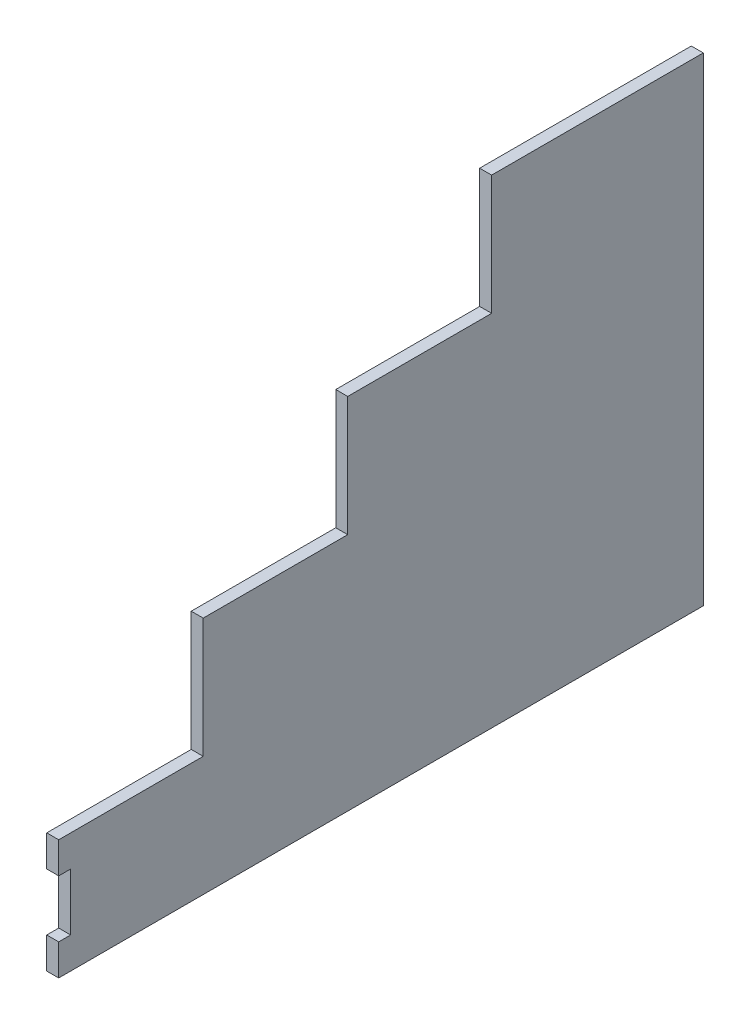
from build123d import *

# Parameters (mm, degrees)
EXTRUDE1_DEPTH = 6.35


with BuildPart() as part:
    # Sketch3 → Extrude1 (new, symmetric)
    with BuildSketch(Plane(origin=(0, 0, 0), x_dir=(0, 0, -1), z_dir=(1, 0, 0))):
        Polygon((-101.6, 0), (-101.6, 508), (-326.106403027, 508), (-326.106403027, 381), (-478.770757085, 381), (-478.770757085, 254), (-632.073318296, 254), (-632.073318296, 127), (-785.375879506, 127), (-785.375879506, 93.809455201), (-772.675879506, 93.809455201), (-772.675879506, 33.190544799), (-785.375879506, 33.190544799), (-785.375879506, 0), align=None)
    extrude(amount=EXTRUDE1_DEPTH, both=True)


solid = part.part
